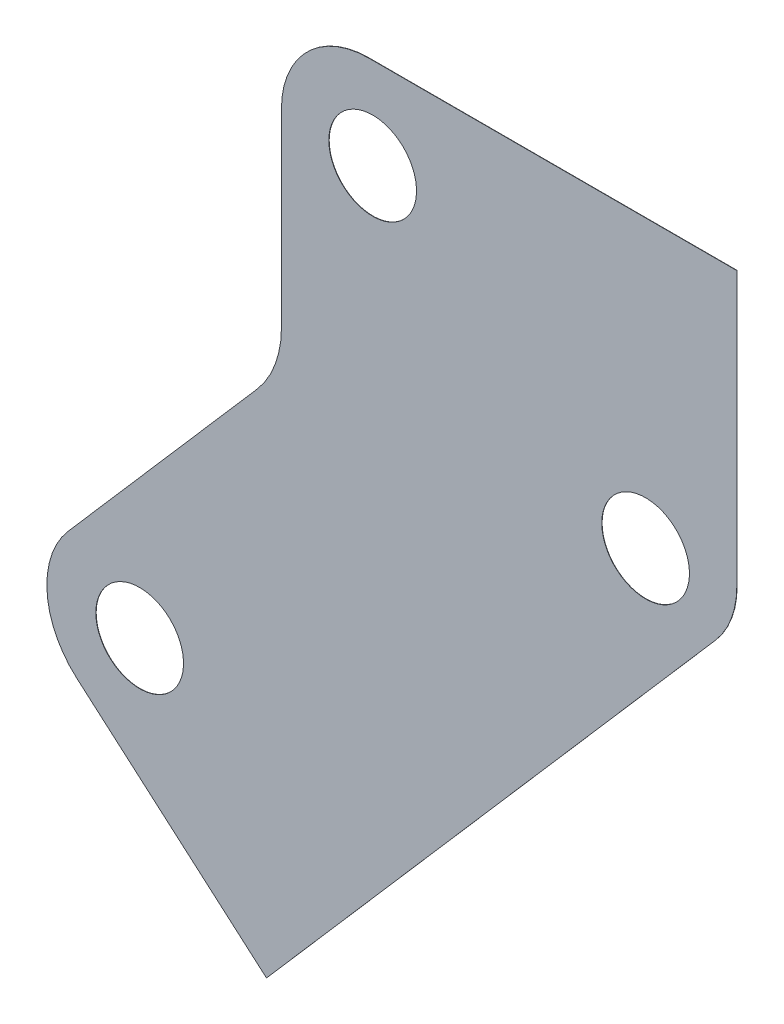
ISO-10303-21;
HEADER;
FILE_DESCRIPTION(('STEP AP214'),'2;1');
FILE_NAME('part.step','',(''),(''),'','','');
FILE_SCHEMA(('AUTOMOTIVE_DESIGN { 1 0 10303 214 1 1 1 1 }'));
ENDSEC;
DATA;
#1=APPLICATION_CONTEXT('core data for automotive mechanical design processes');
#2=APPLICATION_PROTOCOL_DEFINITION('international standard','automotive_design',2000,#1);
#3=PRODUCT_CONTEXT('',#1,'mechanical');
#4=PRODUCT('Part','Part','',(#3));
#5=PRODUCT_RELATED_PRODUCT_CATEGORY('part','',(#4));
#6=PRODUCT_DEFINITION_FORMATION('','',#4);
#7=PRODUCT_DEFINITION_CONTEXT('part definition',#1,'design');
#8=PRODUCT_DEFINITION('design','',#6,#7);
#9=PRODUCT_DEFINITION_SHAPE('','',#8);
#10=(LENGTH_UNIT() NAMED_UNIT(*) SI_UNIT(.MILLI.,.METRE.));
#11=(NAMED_UNIT(*) PLANE_ANGLE_UNIT() SI_UNIT($,.RADIAN.));
#12=(NAMED_UNIT(*) SI_UNIT($,.STERADIAN.) SOLID_ANGLE_UNIT());
#13=UNCERTAINTY_MEASURE_WITH_UNIT(LENGTH_MEASURE(1.E-05),#10,'distance_accuracy_value','');
#14=(GEOMETRIC_REPRESENTATION_CONTEXT(3) GLOBAL_UNCERTAINTY_ASSIGNED_CONTEXT((#13)) GLOBAL_UNIT_ASSIGNED_CONTEXT((#10,
#11,#12)) REPRESENTATION_CONTEXT('',''));
#15=CARTESIAN_POINT('',(0.,0.,0.));
#16=DIRECTION('',(0.,0.,1.));
#17=DIRECTION('',(1.,0.,0.));
#18=AXIS2_PLACEMENT_3D('',#15,#16,#17);
#19=CARTESIAN_POINT('',(-717.823669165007,-69.3455619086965,0.0253999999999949));
#20=DIRECTION('',(0.655690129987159,0.75503010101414,0.));
#21=DIRECTION('',(-0.75503010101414,0.655690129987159,0.));
#22=AXIS2_PLACEMENT_3D('',#19,#20,#21);
#23=PLANE('',#22);
#24=DIRECTION('',(0.75503010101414,-0.655690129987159,0.));
#25=VECTOR('',#24,1.);
#26=CARTESIAN_POINT('',(-717.823669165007,-69.3455619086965,0.));
#27=LINE('',#26,#25);
#28=CARTESIAN_POINT('',(-717.823669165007,-69.3455619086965,0.));
#29=VERTEX_POINT('',#28);
#30=CARTESIAN_POINT('',(-702.385568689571,-82.7524579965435,0.));
#31=VERTEX_POINT('',#30);
#32=EDGE_CURVE('E165',#29,#31,#27,.T.);
#33=ORIENTED_EDGE('',*,*,#32,.T.);
#34=DIRECTION('',(0.,0.,-1.));
#35=VECTOR('',#34,1.);
#36=CARTESIAN_POINT('',(-702.385568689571,-82.7524579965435,0.0253999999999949));
#37=LINE('',#36,#35);
#38=CARTESIAN_POINT('',(-702.385568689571,-82.7524579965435,0.0253999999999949));
#39=VERTEX_POINT('',#38);
#40=EDGE_CURVE('E11',#39,#31,#37,.T.);
#41=ORIENTED_EDGE('',*,*,#40,.F.);
#42=DIRECTION('',(0.75503010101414,-0.655690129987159,0.));
#43=VECTOR('',#42,1.);
#44=CARTESIAN_POINT('',(-717.823669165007,-69.3455619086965,0.0253999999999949));
#45=LINE('',#44,#43);
#46=CARTESIAN_POINT('',(-717.823669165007,-69.3455619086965,0.0253999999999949));
#47=VERTEX_POINT('',#46);
#48=EDGE_CURVE('E194',#47,#39,#45,.T.);
#49=ORIENTED_EDGE('',*,*,#48,.F.);
#50=DIRECTION('',(0.,0.,-1.));
#51=VECTOR('',#50,1.);
#52=CARTESIAN_POINT('',(-717.823669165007,-69.3455619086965,0.0253999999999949));
#53=LINE('',#52,#51);
#54=EDGE_CURVE('E161',#47,#29,#53,.T.);
#55=ORIENTED_EDGE('',*,*,#54,.T.);
#56=EDGE_LOOP('',(#33,#41,#49,#55));
#57=FACE_BOUND('',#56,.T.);
#58=ADVANCED_FACE('F51',(#57),#23,.F.);
#59=CARTESIAN_POINT('',(-702.385568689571,-82.7524579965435,0.0253999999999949));
#60=DIRECTION('',(-0.75503010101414,0.655690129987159,0.));
#61=DIRECTION('',(-0.655690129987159,-0.75503010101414,0.));
#62=AXIS2_PLACEMENT_3D('',#59,#60,#61);
#63=PLANE('',#62);
#64=DIRECTION('',(0.655690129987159,0.75503010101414,0.));
#65=VECTOR('',#64,1.);
#66=CARTESIAN_POINT('',(-702.385568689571,-82.7524579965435,0.));
#67=LINE('',#66,#65);
#68=CARTESIAN_POINT('',(-665.825225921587,-40.6530606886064,0.));
#69=VERTEX_POINT('',#68);
#70=EDGE_CURVE('E169',#31,#69,#67,.T.);
#71=ORIENTED_EDGE('',*,*,#70,.T.);
#72=DIRECTION('',(0.,0.,-1.));
#73=VECTOR('',#72,1.);
#74=CARTESIAN_POINT('',(-665.825225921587,-40.6530606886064,0.0253999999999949));
#75=LINE('',#74,#73);
#76=CARTESIAN_POINT('',(-665.825225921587,-40.6530606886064,0.0253999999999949));
#77=VERTEX_POINT('',#76);
#78=EDGE_CURVE('E60',#77,#69,#75,.T.);
#79=ORIENTED_EDGE('',*,*,#78,.F.);
#80=DIRECTION('',(0.655690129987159,0.75503010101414,0.));
#81=VECTOR('',#80,1.);
#82=CARTESIAN_POINT('',(-702.385568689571,-82.7524579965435,0.0253999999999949));
#83=LINE('',#82,#81);
#84=EDGE_CURVE('E117',#39,#77,#83,.T.);
#85=ORIENTED_EDGE('',*,*,#84,.F.);
#86=ORIENTED_EDGE('',*,*,#40,.T.);
#87=EDGE_LOOP('',(#71,#79,#85,#86));
#88=FACE_BOUND('',#87,.T.);
#89=ADVANCED_FACE('F314',(#88),#63,.F.);
#90=CARTESIAN_POINT('',(-671.195,-35.989792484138,0.0253999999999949));
#91=DIRECTION('',(0.,0.,-1.));
#92=DIRECTION('',(-1.,0.,0.));
#93=AXIS2_PLACEMENT_3D('',#90,#91,#92);
#94=CYLINDRICAL_SURFACE('',#93,7.11199999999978);
#95=CARTESIAN_POINT('',(-671.195,-35.989792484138,0.));
#96=DIRECTION('',(0.,0.,1.));
#97=DIRECTION('',(1.,0.,0.));
#98=AXIS2_PLACEMENT_3D('',#95,#96,#97);
#99=CIRCLE('',#98,7.11199999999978);
#100=CARTESIAN_POINT('',(-664.083,-35.989792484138,0.));
#101=VERTEX_POINT('',#100);
#102=EDGE_CURVE('E173',#69,#101,#99,.T.);
#103=ORIENTED_EDGE('',*,*,#102,.T.);
#104=DIRECTION('',(0.,0.,-1.));
#105=VECTOR('',#104,1.);
#106=CARTESIAN_POINT('',(-664.083,-35.989792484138,0.0253999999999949));
#107=LINE('',#106,#105);
#108=CARTESIAN_POINT('',(-664.083,-35.989792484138,0.0253999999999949));
#109=VERTEX_POINT('',#108);
#110=EDGE_CURVE('E213',#109,#101,#107,.T.);
#111=ORIENTED_EDGE('',*,*,#110,.F.);
#112=CARTESIAN_POINT('',(-671.195,-35.989792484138,0.0253999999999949));
#113=DIRECTION('',(0.,0.,1.));
#114=DIRECTION('',(1.,0.,0.));
#115=AXIS2_PLACEMENT_3D('',#112,#113,#114);
#116=CIRCLE('',#115,7.11199999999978);
#117=EDGE_CURVE('E224',#77,#109,#116,.T.);
#118=ORIENTED_EDGE('',*,*,#117,.F.);
#119=ORIENTED_EDGE('',*,*,#78,.T.);
#120=EDGE_LOOP('',(#103,#111,#118,#119));
#121=FACE_BOUND('',#120,.T.);
#122=ADVANCED_FACE('F222',(#121),#94,.T.);
#123=CARTESIAN_POINT('',(-664.083,-35.989792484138,0.0253999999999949));
#124=DIRECTION('',(-1.,0.,0.));
#125=DIRECTION('',(0.,0.,1.));
#126=AXIS2_PLACEMENT_3D('',#123,#124,#125);
#127=PLANE('',#126);
#128=DIRECTION('',(0.,1.,0.));
#129=VECTOR('',#128,1.);
#130=CARTESIAN_POINT('',(-664.083,-35.989792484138,0.));
#131=LINE('',#130,#129);
#132=CARTESIAN_POINT('',(-664.083,-13.7078728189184,0.));
#133=VERTEX_POINT('',#132);
#134=EDGE_CURVE('E176',#101,#133,#131,.T.);
#135=ORIENTED_EDGE('',*,*,#134,.T.);
#136=DIRECTION('',(0.,0.,-1.));
#137=VECTOR('',#136,1.);
#138=CARTESIAN_POINT('',(-664.083,-13.7078728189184,0.0253999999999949));
#139=LINE('',#138,#137);
#140=CARTESIAN_POINT('',(-664.083,-13.7078728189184,0.0253999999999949));
#141=VERTEX_POINT('',#140);
#142=EDGE_CURVE('E209',#141,#133,#139,.T.);
#143=ORIENTED_EDGE('',*,*,#142,.F.);
#144=DIRECTION('',(0.,1.,0.));
#145=VECTOR('',#144,1.);
#146=CARTESIAN_POINT('',(-664.083,-35.989792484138,0.0253999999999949));
#147=LINE('',#146,#145);
#148=EDGE_CURVE('E243',#109,#141,#147,.T.);
#149=ORIENTED_EDGE('',*,*,#148,.F.);
#150=ORIENTED_EDGE('',*,*,#110,.T.);
#151=EDGE_LOOP('',(#135,#143,#149,#150));
#152=FACE_BOUND('',#151,.T.);
#153=ADVANCED_FACE('F233',(#152),#127,.F.);
#154=CARTESIAN_POINT('',(-664.083,-13.7078728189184,0.0253999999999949));
#155=DIRECTION('',(0.,-1.,0.));
#156=DIRECTION('',(1.,0.,0.));
#157=AXIS2_PLACEMENT_3D('',#154,#155,#156);
#158=PLANE('',#157);
#159=DIRECTION('',(-1.,0.,0.));
#160=VECTOR('',#159,1.);
#161=CARTESIAN_POINT('',(-664.083,-13.7078728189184,0.));
#162=LINE('',#161,#160);
#163=CARTESIAN_POINT('',(-694.055,-13.7078728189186,0.));
#164=VERTEX_POINT('',#163);
#165=EDGE_CURVE('E179',#133,#164,#162,.T.);
#166=ORIENTED_EDGE('',*,*,#165,.T.);
#167=DIRECTION('',(0.,0.,-1.));
#168=VECTOR('',#167,1.);
#169=CARTESIAN_POINT('',(-694.055,-13.7078728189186,0.0253999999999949));
#170=LINE('',#169,#168);
#171=CARTESIAN_POINT('',(-694.055,-13.7078728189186,0.0253999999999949));
#172=VERTEX_POINT('',#171);
#173=EDGE_CURVE('E205',#172,#164,#170,.T.);
#174=ORIENTED_EDGE('',*,*,#173,.F.);
#175=DIRECTION('',(-1.,0.,0.));
#176=VECTOR('',#175,1.);
#177=CARTESIAN_POINT('',(-664.083,-13.7078728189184,0.0253999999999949));
#178=LINE('',#177,#176);
#179=EDGE_CURVE('E239',#141,#172,#178,.T.);
#180=ORIENTED_EDGE('',*,*,#179,.F.);
#181=ORIENTED_EDGE('',*,*,#142,.T.);
#182=EDGE_LOOP('',(#166,#174,#180,#181));
#183=FACE_BOUND('',#182,.T.);
#184=ADVANCED_FACE('F237',(#183),#158,.F.);
#185=CARTESIAN_POINT('',(-694.055,-20.8198728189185,0.0253999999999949));
#186=DIRECTION('',(0.,0.,-1.));
#187=DIRECTION('',(-1.,0.,0.));
#188=AXIS2_PLACEMENT_3D('',#185,#186,#187);
#189=CYLINDRICAL_SURFACE('',#188,7.11199999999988);
#190=CARTESIAN_POINT('',(-694.055,-20.8198728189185,0.));
#191=DIRECTION('',(0.,0.,1.));
#192=DIRECTION('',(1.,0.,0.));
#193=AXIS2_PLACEMENT_3D('',#190,#191,#192);
#194=CIRCLE('',#193,7.11199999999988);
#195=CARTESIAN_POINT('',(-701.167,-20.8198728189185,0.));
#196=VERTEX_POINT('',#195);
#197=EDGE_CURVE('E182',#164,#196,#194,.T.);
#198=ORIENTED_EDGE('',*,*,#197,.T.);
#199=DIRECTION('',(0.,0.,-1.));
#200=VECTOR('',#199,1.);
#201=CARTESIAN_POINT('',(-701.167,-20.8198728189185,0.0253999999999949));
#202=LINE('',#201,#200);
#203=CARTESIAN_POINT('',(-701.167,-20.8198728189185,0.0253999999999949));
#204=VERTEX_POINT('',#203);
#205=EDGE_CURVE('E201',#204,#196,#202,.T.);
#206=ORIENTED_EDGE('',*,*,#205,.F.);
#207=CARTESIAN_POINT('',(-694.055,-20.8198728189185,0.0253999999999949));
#208=DIRECTION('',(0.,0.,1.));
#209=DIRECTION('',(1.,0.,0.));
#210=AXIS2_PLACEMENT_3D('',#207,#208,#209);
#211=CIRCLE('',#210,7.11199999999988);
#212=EDGE_CURVE('E242',#172,#204,#211,.T.);
#213=ORIENTED_EDGE('',*,*,#212,.F.);
#214=ORIENTED_EDGE('',*,*,#173,.T.);
#215=EDGE_LOOP('',(#198,#206,#213,#214));
#216=FACE_BOUND('',#215,.T.);
#217=ADVANCED_FACE('F326',(#216),#189,.T.);
#218=CARTESIAN_POINT('',(-701.167,-20.8198728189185,0.0253999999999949));
#219=DIRECTION('',(1.,0.,0.));
#220=DIRECTION('',(0.,1.,0.));
#221=AXIS2_PLACEMENT_3D('',#218,#219,#220);
#222=PLANE('',#221);
#223=DIRECTION('',(0.,-1.,0.));
#224=VECTOR('',#223,1.);
#225=CARTESIAN_POINT('',(-701.167,-20.8198728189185,0.));
#226=LINE('',#225,#224);
#227=CARTESIAN_POINT('',(-701.167,-36.2820751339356,0.));
#228=VERTEX_POINT('',#227);
#229=EDGE_CURVE('E185',#196,#228,#226,.T.);
#230=ORIENTED_EDGE('',*,*,#229,.T.);
#231=DIRECTION('',(0.,0.,-1.));
#232=VECTOR('',#231,1.);
#233=CARTESIAN_POINT('',(-701.167,-36.2820751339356,0.0253999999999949));
#234=LINE('',#233,#232);
#235=CARTESIAN_POINT('',(-701.167,-36.2820751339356,0.0253999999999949));
#236=VERTEX_POINT('',#235);
#237=EDGE_CURVE('E153',#236,#228,#234,.T.);
#238=ORIENTED_EDGE('',*,*,#237,.F.);
#239=DIRECTION('',(0.,-1.,0.));
#240=VECTOR('',#239,1.);
#241=CARTESIAN_POINT('',(-701.167,-20.8198728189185,0.0253999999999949));
#242=LINE('',#241,#240);
#243=EDGE_CURVE('E142',#204,#236,#242,.T.);
#244=ORIENTED_EDGE('',*,*,#243,.F.);
#245=ORIENTED_EDGE('',*,*,#205,.T.);
#246=EDGE_LOOP('',(#230,#238,#244,#245));
#247=FACE_BOUND('',#246,.T.);
#248=ADVANCED_FACE('F323',(#247),#222,.F.);
#249=CARTESIAN_POINT('',(-709.295,-36.2820751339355,0.0253999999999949));
#250=DIRECTION('',(0.,0.,-1.));
#251=DIRECTION('',(-1.,0.,0.));
#252=AXIS2_PLACEMENT_3D('',#249,#250,#251);
#253=CYLINDRICAL_SURFACE('',#252,8.12799999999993);
#254=CARTESIAN_POINT('',(-709.295,-36.2820751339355,0.));
#255=DIRECTION('',(0.,0.,-1.));
#256=DIRECTION('',(1.,0.,0.));
#257=AXIS2_PLACEMENT_3D('',#254,#255,#256);
#258=CIRCLE('',#257,8.12799999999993);
#259=CARTESIAN_POINT('',(-703.158115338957,-41.6115245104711,0.));
#260=VERTEX_POINT('',#259);
#261=EDGE_CURVE('E151',#228,#260,#258,.T.);
#262=ORIENTED_EDGE('',*,*,#261,.T.);
#263=DIRECTION('',(0.,0.,-1.));
#264=VECTOR('',#263,1.);
#265=CARTESIAN_POINT('',(-703.158115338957,-41.6115245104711,0.0253999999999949));
#266=LINE('',#265,#264);
#267=CARTESIAN_POINT('',(-703.158115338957,-41.6115245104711,0.0253999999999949));
#268=VERTEX_POINT('',#267);
#269=EDGE_CURVE('E148',#268,#260,#266,.T.);
#270=ORIENTED_EDGE('',*,*,#269,.F.);
#271=CARTESIAN_POINT('',(-709.295,-36.2820751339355,0.0253999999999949));
#272=DIRECTION('',(0.,0.,-1.));
#273=DIRECTION('',(1.,0.,0.));
#274=AXIS2_PLACEMENT_3D('',#271,#272,#273);
#275=CIRCLE('',#274,8.12799999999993);
#276=EDGE_CURVE('E136',#236,#268,#275,.T.);
#277=ORIENTED_EDGE('',*,*,#276,.F.);
#278=ORIENTED_EDGE('',*,*,#237,.T.);
#279=EDGE_LOOP('',(#262,#270,#277,#278));
#280=FACE_BOUND('',#279,.T.);
#281=ADVANCED_FACE('F149',(#280),#253,.F.);
#282=CARTESIAN_POINT('',(-703.158115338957,-41.6115245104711,0.0253999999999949));
#283=DIRECTION('',(0.755030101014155,-0.655690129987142,0.));
#284=DIRECTION('',(0.655690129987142,0.755030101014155,0.));
#285=AXIS2_PLACEMENT_3D('',#282,#283,#284);
#286=PLANE('',#285);
#287=DIRECTION('',(-0.655690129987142,-0.755030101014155,0.));
#288=VECTOR('',#287,1.);
#289=CARTESIAN_POINT('',(-703.158115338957,-41.6115245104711,0.));
#290=LINE('',#289,#288);
#291=CARTESIAN_POINT('',(-718.530175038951,-59.3125196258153,0.));
#292=VERTEX_POINT('',#291);
#293=EDGE_CURVE('E103',#260,#292,#290,.T.);
#294=ORIENTED_EDGE('',*,*,#293,.T.);
#295=DIRECTION('',(0.,0.,-1.));
#296=VECTOR('',#295,1.);
#297=CARTESIAN_POINT('',(-718.530175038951,-59.3125196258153,0.0253999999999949));
#298=LINE('',#297,#296);
#299=CARTESIAN_POINT('',(-718.530175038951,-59.3125196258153,0.0253999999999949));
#300=VERTEX_POINT('',#299);
#301=EDGE_CURVE('E154',#300,#292,#298,.T.);
#302=ORIENTED_EDGE('',*,*,#301,.F.);
#303=DIRECTION('',(-0.655690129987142,-0.755030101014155,0.));
#304=VECTOR('',#303,1.);
#305=CARTESIAN_POINT('',(-703.158115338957,-41.6115245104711,0.0253999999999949));
#306=LINE('',#305,#304);
#307=EDGE_CURVE('E140',#268,#300,#306,.T.);
#308=ORIENTED_EDGE('',*,*,#307,.F.);
#309=ORIENTED_EDGE('',*,*,#269,.T.);
#310=EDGE_LOOP('',(#294,#302,#308,#309));
#311=FACE_BOUND('',#310,.T.);
#312=ADVANCED_FACE('F156',(#311),#286,.F.);
#313=CARTESIAN_POINT('',(-713.160400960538,-63.9757878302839,0.0253999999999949));
#314=DIRECTION('',(0.,0.,-1.));
#315=DIRECTION('',(-1.,0.,0.));
#316=AXIS2_PLACEMENT_3D('',#313,#314,#315);
#317=CYLINDRICAL_SURFACE('',#316,7.11200000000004);
#318=CARTESIAN_POINT('',(-713.160400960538,-63.9757878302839,0.));
#319=DIRECTION('',(0.,0.,1.));
#320=DIRECTION('',(1.,0.,0.));
#321=AXIS2_PLACEMENT_3D('',#318,#319,#320);
#322=CIRCLE('',#321,7.11200000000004);
#323=EDGE_CURVE('E109',#292,#29,#322,.T.);
#324=ORIENTED_EDGE('',*,*,#323,.T.);
#325=ORIENTED_EDGE('',*,*,#54,.F.);
#326=CARTESIAN_POINT('',(-713.160400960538,-63.9757878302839,0.0253999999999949));
#327=DIRECTION('',(0.,0.,1.));
#328=DIRECTION('',(1.,0.,0.));
#329=AXIS2_PLACEMENT_3D('',#326,#327,#328);
#330=CIRCLE('',#329,7.11200000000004);
#331=EDGE_CURVE('E68',#300,#47,#330,.T.);
#332=ORIENTED_EDGE('',*,*,#331,.F.);
#333=ORIENTED_EDGE('',*,*,#301,.T.);
#334=EDGE_LOOP('',(#324,#325,#332,#333));
#335=FACE_BOUND('',#334,.T.);
#336=ADVANCED_FACE('F381',(#335),#317,.T.);
#337=CARTESIAN_POINT('',(-671.195,-35.989792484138,0.0253999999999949));
#338=DIRECTION('',(0.,0.,1.));
#339=DIRECTION('',(1.,0.,0.));
#340=AXIS2_PLACEMENT_3D('',#337,#338,#339);
#341=PLANE('',#340);
#342=CARTESIAN_POINT('',(-693.737499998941,-21.1373728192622,0.0253999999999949));
#343=DIRECTION('',(0.,0.,-1.));
#344=DIRECTION('',(-1.,0.,0.));
#345=AXIS2_PLACEMENT_3D('',#342,#343,#344);
#346=CIRCLE('',#345,3.56869999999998);
#347=CARTESIAN_POINT('',(-697.306199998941,-21.1373728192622,0.0253999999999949));
#348=VERTEX_POINT('',#347);
#349=EDGE_CURVE('E280',#348,#348,#346,.T.);
#350=ORIENTED_EDGE('',*,*,#349,.T.);
#351=EDGE_LOOP('',(#350));
#352=FACE_BOUND('',#351,.T.);
#353=CARTESIAN_POINT('',(-712.712497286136,-63.9442473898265,0.0253999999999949));
#354=DIRECTION('',(0.,0.,-1.));
#355=DIRECTION('',(-1.,0.,0.));
#356=AXIS2_PLACEMENT_3D('',#353,#354,#355);
#357=CIRCLE('',#356,3.56869999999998);
#358=CARTESIAN_POINT('',(-716.281197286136,-63.9442473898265,0.0253999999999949));
#359=VERTEX_POINT('',#358);
#360=EDGE_CURVE('E272',#359,#359,#357,.T.);
#361=ORIENTED_EDGE('',*,*,#360,.T.);
#362=EDGE_LOOP('',(#361));
#363=FACE_BOUND('',#362,.T.);
#364=CARTESIAN_POINT('',(-671.512499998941,-37.0123728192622,0.0253999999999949));
#365=DIRECTION('',(0.,0.,-1.));
#366=DIRECTION('',(-1.,0.,0.));
#367=AXIS2_PLACEMENT_3D('',#364,#365,#366);
#368=CIRCLE('',#367,3.56869999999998);
#369=CARTESIAN_POINT('',(-675.081199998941,-37.0123728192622,0.0253999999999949));
#370=VERTEX_POINT('',#369);
#371=EDGE_CURVE('E264',#370,#370,#368,.T.);
#372=ORIENTED_EDGE('',*,*,#371,.T.);
#373=EDGE_LOOP('',(#372));
#374=FACE_BOUND('',#373,.T.);
#375=ORIENTED_EDGE('',*,*,#48,.T.);
#376=ORIENTED_EDGE('',*,*,#84,.T.);
#377=ORIENTED_EDGE('',*,*,#117,.T.);
#378=ORIENTED_EDGE('',*,*,#148,.T.);
#379=ORIENTED_EDGE('',*,*,#179,.T.);
#380=ORIENTED_EDGE('',*,*,#212,.T.);
#381=ORIENTED_EDGE('',*,*,#243,.T.);
#382=ORIENTED_EDGE('',*,*,#276,.T.);
#383=ORIENTED_EDGE('',*,*,#307,.T.);
#384=ORIENTED_EDGE('',*,*,#331,.T.);
#385=EDGE_LOOP('',(#375,#376,#377,#378,#379,#380,#381,#382,#383,#384));
#386=FACE_BOUND('',#385,.T.);
#387=ADVANCED_FACE('F138',(#352,#363,#374,#386),#341,.T.);
#388=CARTESIAN_POINT('',(-671.195,-35.989792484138,0.));
#389=DIRECTION('',(0.,0.,1.));
#390=DIRECTION('',(1.,0.,0.));
#391=AXIS2_PLACEMENT_3D('',#388,#389,#390);
#392=PLANE('',#391);
#393=CARTESIAN_POINT('',(-693.737499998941,-21.1373728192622,0.));
#394=DIRECTION('',(0.,0.,-1.));
#395=DIRECTION('',(-1.,0.,0.));
#396=AXIS2_PLACEMENT_3D('',#393,#394,#395);
#397=CIRCLE('',#396,3.56869999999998);
#398=CARTESIAN_POINT('',(-697.306199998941,-21.1373728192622,0.));
#399=VERTEX_POINT('',#398);
#400=EDGE_CURVE('E276',#399,#399,#397,.T.);
#401=ORIENTED_EDGE('',*,*,#400,.F.);
#402=EDGE_LOOP('',(#401));
#403=FACE_BOUND('',#402,.T.);
#404=CARTESIAN_POINT('',(-712.712497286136,-63.9442473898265,0.));
#405=DIRECTION('',(0.,0.,-1.));
#406=DIRECTION('',(-1.,0.,0.));
#407=AXIS2_PLACEMENT_3D('',#404,#405,#406);
#408=CIRCLE('',#407,3.56869999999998);
#409=CARTESIAN_POINT('',(-716.281197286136,-63.9442473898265,0.));
#410=VERTEX_POINT('',#409);
#411=EDGE_CURVE('E268',#410,#410,#408,.T.);
#412=ORIENTED_EDGE('',*,*,#411,.F.);
#413=EDGE_LOOP('',(#412));
#414=FACE_BOUND('',#413,.T.);
#415=CARTESIAN_POINT('',(-671.512499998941,-37.0123728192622,0.));
#416=DIRECTION('',(0.,0.,-1.));
#417=DIRECTION('',(-1.,0.,0.));
#418=AXIS2_PLACEMENT_3D('',#415,#416,#417);
#419=CIRCLE('',#418,3.56869999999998);
#420=CARTESIAN_POINT('',(-675.081199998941,-37.0123728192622,0.));
#421=VERTEX_POINT('',#420);
#422=EDGE_CURVE('E170',#421,#421,#419,.T.);
#423=ORIENTED_EDGE('',*,*,#422,.F.);
#424=EDGE_LOOP('',(#423));
#425=FACE_BOUND('',#424,.T.);
#426=ORIENTED_EDGE('',*,*,#32,.F.);
#427=ORIENTED_EDGE('',*,*,#323,.F.);
#428=ORIENTED_EDGE('',*,*,#293,.F.);
#429=ORIENTED_EDGE('',*,*,#261,.F.);
#430=ORIENTED_EDGE('',*,*,#229,.F.);
#431=ORIENTED_EDGE('',*,*,#197,.F.);
#432=ORIENTED_EDGE('',*,*,#165,.F.);
#433=ORIENTED_EDGE('',*,*,#134,.F.);
#434=ORIENTED_EDGE('',*,*,#102,.F.);
#435=ORIENTED_EDGE('',*,*,#70,.F.);
#436=EDGE_LOOP('',(#426,#427,#428,#429,#430,#431,#432,#433,#434,#435));
#437=FACE_BOUND('',#436,.T.);
#438=ADVANCED_FACE('F228',(#403,#414,#425,#437),#392,.F.);
#439=CARTESIAN_POINT('',(-671.512499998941,-37.0123728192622,0.));
#440=DIRECTION('',(0.,0.,-1.));
#441=DIRECTION('',(-1.,0.,0.));
#442=AXIS2_PLACEMENT_3D('',#439,#440,#441);
#443=CYLINDRICAL_SURFACE('',#442,3.56869999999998);
#444=ORIENTED_EDGE('',*,*,#371,.F.);
#445=EDGE_LOOP('',(#444));
#446=FACE_BOUND('',#445,.T.);
#447=ORIENTED_EDGE('',*,*,#422,.T.);
#448=EDGE_LOOP('',(#447));
#449=FACE_BOUND('',#448,.T.);
#450=ADVANCED_FACE('F297',(#446,#449),#443,.F.);
#451=CARTESIAN_POINT('',(-712.712497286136,-63.9442473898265,0.));
#452=DIRECTION('',(0.,0.,-1.));
#453=DIRECTION('',(-1.,0.,0.));
#454=AXIS2_PLACEMENT_3D('',#451,#452,#453);
#455=CYLINDRICAL_SURFACE('',#454,3.56869999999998);
#456=ORIENTED_EDGE('',*,*,#360,.F.);
#457=EDGE_LOOP('',(#456));
#458=FACE_BOUND('',#457,.T.);
#459=ORIENTED_EDGE('',*,*,#411,.T.);
#460=EDGE_LOOP('',(#459));
#461=FACE_BOUND('',#460,.T.);
#462=ADVANCED_FACE('F291',(#458,#461),#455,.F.);
#463=CARTESIAN_POINT('',(-693.737499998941,-21.1373728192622,0.));
#464=DIRECTION('',(0.,0.,-1.));
#465=DIRECTION('',(-1.,0.,0.));
#466=AXIS2_PLACEMENT_3D('',#463,#464,#465);
#467=CYLINDRICAL_SURFACE('',#466,3.56869999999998);
#468=ORIENTED_EDGE('',*,*,#349,.F.);
#469=EDGE_LOOP('',(#468));
#470=FACE_BOUND('',#469,.T.);
#471=ORIENTED_EDGE('',*,*,#400,.T.);
#472=EDGE_LOOP('',(#471));
#473=FACE_BOUND('',#472,.T.);
#474=ADVANCED_FACE('F288',(#470,#473),#467,.F.);
#475=CLOSED_SHELL('',(#58,#89,#122,#153,#184,#217,#248,#281,#312,#336,#387,#438,#450,#462,#474));
#476=MANIFOLD_SOLID_BREP('B2',#475);
#477=ADVANCED_BREP_SHAPE_REPRESENTATION('',(#18,#476),#14);
#478=SHAPE_DEFINITION_REPRESENTATION(#9,#477);
ENDSEC;
END-ISO-10303-21;
